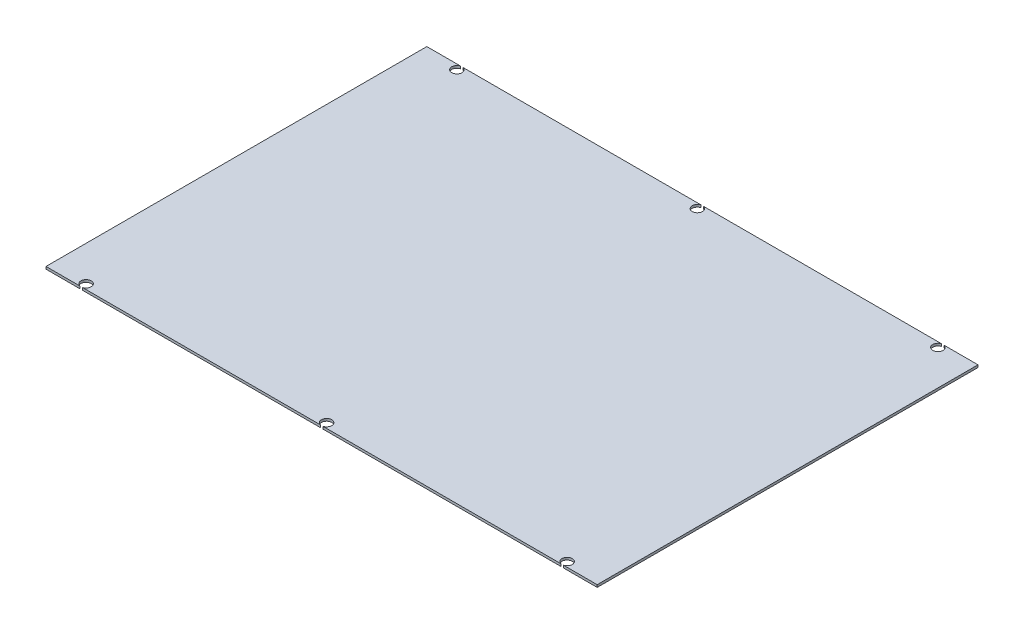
from build123d import *

# Parameters (mm, degrees)
SKETCH1_W                 = 174.625
SKETCH1_H                 = 120.65
EXTRUDE1_DEPTH            = 0.762
F_4_CLEARANCE_HOLE1_D     = 3.2639
F_4_CLEARANCE_HOLE1_DEPTH = 3.302
F_4_CLEARANCE_HOLE1_TIP   = 0.980574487


with BuildPart() as part:
    # Sketch1 → Extrude1 (new body)
    with BuildSketch(Plane(origin=(0, 0, 0), x_dir=(1, 0, 0), z_dir=(0, 1, 0))):
        with Locations((87.3125, 60.325)):
            Rectangle(SKETCH1_W, SKETCH1_H)
    extrude(amount=EXTRUDE1_DEPTH)

    # 4 Clearance Hole1
    with Locations(Plane(origin=(0, 0.762, 0), x_dir=(-1, 0, 0), z_dir=(0, 1, 0))):
        with Locations((-11.1125, -1.5875), (-87.3125, -1.5875), (-163.5125, -1.5875), (-87.3125, -119.0625), (-163.5125, -119.0625), (-11.1125, -119.0625)):
            Hole(F_4_CLEARANCE_HOLE1_D / 2, depth=F_4_CLEARANCE_HOLE1_DEPTH)
            with Locations((0, 0, -(F_4_CLEARANCE_HOLE1_DEPTH + F_4_CLEARANCE_HOLE1_TIP / 2))):  # 118° drill point
                Cone(0, F_4_CLEARANCE_HOLE1_D / 2, F_4_CLEARANCE_HOLE1_TIP, mode=Mode.SUBTRACT)


solid = part.part
